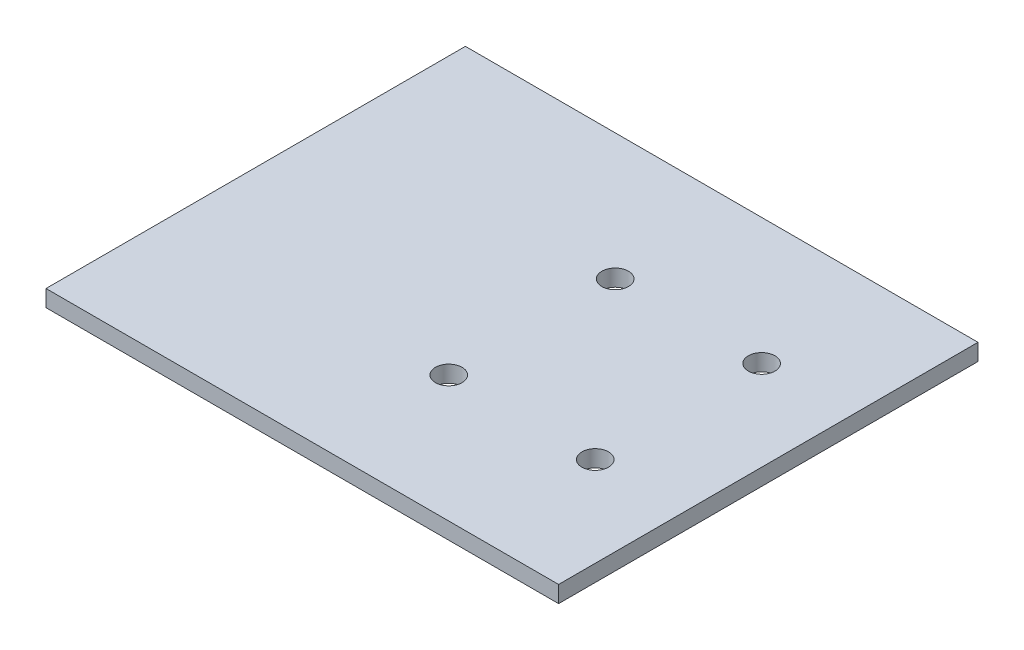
from build123d import *

# Parameters (mm, degrees)
SKETCH1_W           = 77
SKETCH1_H           = 63
SKETCH1_R           = 2
BOSS_EXTRUDE1_DEPTH = 2.5


with BuildPart() as part:
    # Sketch1 → Boss-Extrude1 (new body)
    with BuildSketch(Plane(origin=(0, 0, 0), x_dir=(1, 0, 0), z_dir=(0, 1, 0))):
        Rectangle(SKETCH1_W, SKETCH1_H)
        with Locations(Location((25, 12.5, 0), (0, 0, 270))):
            Circle(SKETCH1_R, mode=Mode.SUBTRACT)
        with Locations(Location((25, -12.5, 0), (0, 0, 270))):
            Circle(SKETCH1_R, mode=Mode.SUBTRACT)
        with Locations(Location((3, 12.5, 0), (0, 0, 270))):
            Circle(SKETCH1_R, mode=Mode.SUBTRACT)
        with Locations(Location((3, -12.5, 0), (0, 0, 270))):
            Circle(SKETCH1_R, mode=Mode.SUBTRACT)
    extrude(amount=BOSS_EXTRUDE1_DEPTH)


solid = part.part
